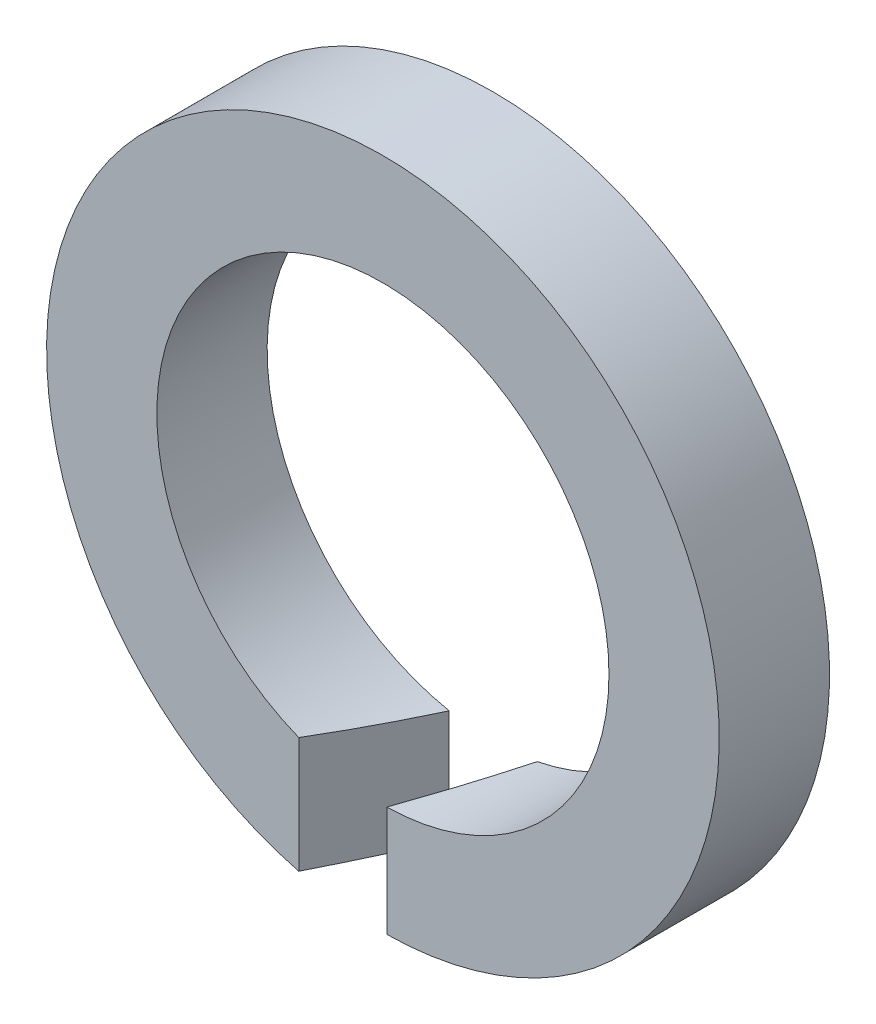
from build123d import *

# Parameters (mm, degrees)
SKETCH_1_R          = 6.1
SKETCH_1_R_2        = 4.1
EXTRUDE_143_DEPTH   = 2
CUT_EXTRUDE_1_DEPTH = 9.855506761


with BuildPart() as part:
    # Sketch 1 → Extrude 143 (new body)
    with BuildSketch(Plane.XY):
        Circle(SKETCH_1_R)
        Circle(SKETCH_1_R_2, mode=Mode.SUBTRACT)
    extrude(amount=EXTRUDE_143_DEPTH)

    # Sketch 2 → Cut-Extrude 1 (cut, through all)
    with BuildSketch(Plane(origin=(0, 0, 0), x_dir=(1, 0, 0), z_dir=(0, 1, 0))):
        Polygon((0.798133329, 0), (-0.798133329, 0), (-1.526073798, -2), (0.070192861, -2), align=None)
    extrude(amount=-CUT_EXTRUDE_1_DEPTH, mode=Mode.SUBTRACT)


solid = part.part
